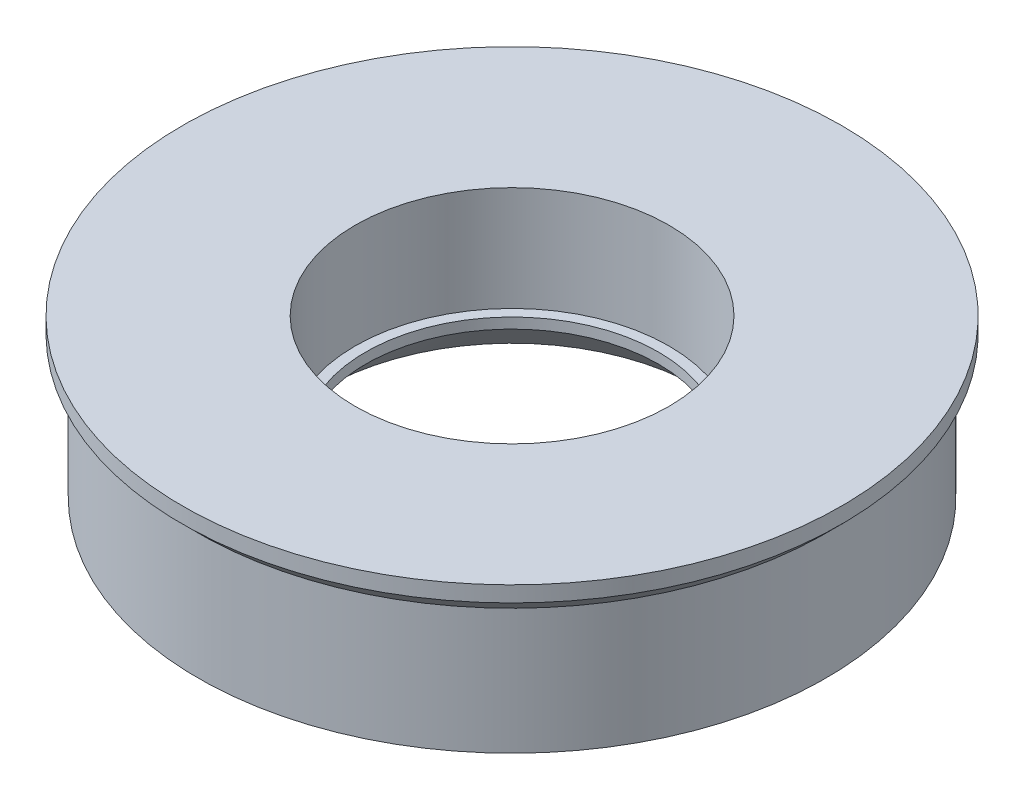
ISO-10303-21;
HEADER;
FILE_DESCRIPTION(('STEP AP214'),'2;1');
FILE_NAME('part.step','',(''),(''),'','','');
FILE_SCHEMA(('AUTOMOTIVE_DESIGN { 1 0 10303 214 1 1 1 1 }'));
ENDSEC;
DATA;
#1=APPLICATION_CONTEXT('core data for automotive mechanical design processes');
#2=APPLICATION_PROTOCOL_DEFINITION('international standard','automotive_design',2000,#1);
#3=PRODUCT_CONTEXT('',#1,'mechanical');
#4=PRODUCT('Part','Part','',(#3));
#5=PRODUCT_RELATED_PRODUCT_CATEGORY('part','',(#4));
#6=PRODUCT_DEFINITION_FORMATION('','',#4);
#7=PRODUCT_DEFINITION_CONTEXT('part definition',#1,'design');
#8=PRODUCT_DEFINITION('design','',#6,#7);
#9=PRODUCT_DEFINITION_SHAPE('','',#8);
#10=(LENGTH_UNIT() NAMED_UNIT(*) SI_UNIT(.MILLI.,.METRE.));
#11=(NAMED_UNIT(*) PLANE_ANGLE_UNIT() SI_UNIT($,.RADIAN.));
#12=(NAMED_UNIT(*) SI_UNIT($,.STERADIAN.) SOLID_ANGLE_UNIT());
#13=UNCERTAINTY_MEASURE_WITH_UNIT(LENGTH_MEASURE(1.E-05),#10,'distance_accuracy_value','');
#14=(GEOMETRIC_REPRESENTATION_CONTEXT(3) GLOBAL_UNCERTAINTY_ASSIGNED_CONTEXT((#13)) GLOBAL_UNIT_ASSIGNED_CONTEXT((#10,
#11,#12)) REPRESENTATION_CONTEXT('',''));
#15=CARTESIAN_POINT('',(0.,0.,0.));
#16=DIRECTION('',(0.,0.,1.));
#17=DIRECTION('',(1.,0.,0.));
#18=AXIS2_PLACEMENT_3D('',#15,#16,#17);
#19=CARTESIAN_POINT('',(15.,4.9999999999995,0.));
#20=DIRECTION('',(0.,1.,0.));
#21=DIRECTION('',(0.,0.,1.));
#22=AXIS2_PLACEMENT_3D('',#19,#20,#21);
#23=PLANE('',#22);
#24=CARTESIAN_POINT('',(0.,4.9999999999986,2.22044604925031E-13));
#25=DIRECTION('',(0.,-1.,0.));
#26=DIRECTION('',(0.,0.,-1.));
#27=AXIS2_PLACEMENT_3D('',#24,#25,#26);
#28=CIRCLE('',#27,14.);
#29=CARTESIAN_POINT('',(0.,4.9999999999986,-13.9999999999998));
#30=VERTEX_POINT('',#29);
#31=EDGE_CURVE('E54',#30,#30,#28,.T.);
#32=ORIENTED_EDGE('',*,*,#31,.T.);
#33=EDGE_LOOP('',(#32));
#34=FACE_BOUND('',#33,.T.);
#35=CARTESIAN_POINT('',(0.,4.9999999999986,2.22044604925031E-13));
#36=DIRECTION('',(0.,-1.,0.));
#37=DIRECTION('',(0.,0.,-1.));
#38=AXIS2_PLACEMENT_3D('',#35,#36,#37);
#39=CIRCLE('',#38,15.);
#40=CARTESIAN_POINT('',(0.,4.9999999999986,-14.9999999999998));
#41=VERTEX_POINT('',#40);
#42=EDGE_CURVE('E71',#41,#41,#39,.T.);
#43=ORIENTED_EDGE('',*,*,#42,.F.);
#44=EDGE_LOOP('',(#43));
#45=FACE_BOUND('',#44,.T.);
#46=ADVANCED_FACE('F40',(#34,#45),#23,.T.);
#47=CARTESIAN_POINT('',(-1.11022302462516E-13,-1.16573417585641E-12,1.66533453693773E-13));
#48=DIRECTION('',(0.,-1.,0.));
#49=DIRECTION('',(0.,0.,-1.));
#50=AXIS2_PLACEMENT_3D('',#47,#48,#49);
#51=CYLINDRICAL_SURFACE('',#50,14.);
#52=CARTESIAN_POINT('',(0.,3.99999999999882,2.22044604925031E-13));
#53=DIRECTION('',(0.,-1.,0.));
#54=DIRECTION('',(0.,0.,-1.));
#55=AXIS2_PLACEMENT_3D('',#52,#53,#54);
#56=CIRCLE('',#55,14.);
#57=CARTESIAN_POINT('',(0.,3.99999999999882,-13.9999999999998));
#58=VERTEX_POINT('',#57);
#59=EDGE_CURVE('E50',#58,#58,#56,.T.);
#60=ORIENTED_EDGE('',*,*,#59,.T.);
#61=EDGE_LOOP('',(#60));
#62=FACE_BOUND('',#61,.T.);
#63=ORIENTED_EDGE('',*,*,#31,.F.);
#64=EDGE_LOOP('',(#63));
#65=FACE_BOUND('',#64,.T.);
#66=ADVANCED_FACE('F79',(#62,#65),#51,.F.);
#67=CARTESIAN_POINT('',(14.,0.,0.));
#68=DIRECTION('',(0.,-1.,0.));
#69=DIRECTION('',(0.,0.,-1.));
#70=AXIS2_PLACEMENT_3D('',#67,#68,#69);
#71=PLANE('',#70);
#72=CARTESIAN_POINT('',(-1.11022302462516E-13,-1.16573417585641E-12,1.66533453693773E-13));
#73=DIRECTION('',(0.,-1.,0.));
#74=DIRECTION('',(0.,0.,-1.));
#75=AXIS2_PLACEMENT_3D('',#72,#73,#74);
#76=CIRCLE('',#75,18.);
#77=CARTESIAN_POINT('',(-1.0902390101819E-13,-1.1662337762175E-12,-17.9999999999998));
#78=VERTEX_POINT('',#77);
#79=EDGE_CURVE('E46',#78,#78,#76,.F.);
#80=ORIENTED_EDGE('',*,*,#79,.T.);
#81=EDGE_LOOP('',(#80));
#82=FACE_BOUND('',#81,.T.);
#83=CARTESIAN_POINT('',(-1.11022302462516E-13,-1.16573417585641E-12,1.66533453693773E-13));
#84=DIRECTION('',(0.,-1.,0.));
#85=DIRECTION('',(0.,0.,-1.));
#86=AXIS2_PLACEMENT_3D('',#83,#84,#85);
#87=CIRCLE('',#86,30.);
#88=CARTESIAN_POINT('',(-1.0769163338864E-13,-1.16656684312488E-12,-29.9999999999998));
#89=VERTEX_POINT('',#88);
#90=EDGE_CURVE('E59',#89,#89,#87,.T.);
#91=ORIENTED_EDGE('',*,*,#90,.T.);
#92=EDGE_LOOP('',(#91));
#93=FACE_BOUND('',#92,.T.);
#94=ADVANCED_FACE('F84',(#82,#93),#71,.T.);
#95=CARTESIAN_POINT('',(-1.11022302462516E-13,-1.16573417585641E-12,1.66533453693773E-13));
#96=DIRECTION('',(0.,-1.,0.));
#97=DIRECTION('',(0.,0.,-1.));
#98=AXIS2_PLACEMENT_3D('',#95,#96,#97);
#99=CYLINDRICAL_SURFACE('',#98,30.);
#100=CARTESIAN_POINT('',(-1.11022302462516E-13,11.9999999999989,3.05311331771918E-13));
#101=DIRECTION('',(0.,-1.,0.));
#102=DIRECTION('',(0.,0.,-1.));
#103=AXIS2_PLACEMENT_3D('',#100,#101,#102);
#104=CIRCLE('',#103,30.);
#105=CARTESIAN_POINT('',(-1.0769163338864E-13,11.9999999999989,-29.9999999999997));
#106=VERTEX_POINT('',#105);
#107=EDGE_CURVE('E62',#106,#106,#104,.T.);
#108=ORIENTED_EDGE('',*,*,#107,.T.);
#109=EDGE_LOOP('',(#108));
#110=FACE_BOUND('',#109,.T.);
#111=ORIENTED_EDGE('',*,*,#90,.F.);
#112=EDGE_LOOP('',(#111));
#113=FACE_BOUND('',#112,.T.);
#114=ADVANCED_FACE('F91',(#110,#113),#99,.T.);
#115=CARTESIAN_POINT('',(-1.11022302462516E-13,-1.16573417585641E-12,1.66533453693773E-13));
#116=DIRECTION('',(0.,-1.,0.));
#117=DIRECTION('',(0.,0.,-1.));
#118=AXIS2_PLACEMENT_3D('',#115,#116,#117);
#119=CYLINDRICAL_SURFACE('',#118,31.5);
#120=CARTESIAN_POINT('',(0.,13.4999999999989,2.4980018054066E-13));
#121=DIRECTION('',(0.,-1.,0.));
#122=DIRECTION('',(0.,0.,-1.));
#123=AXIS2_PLACEMENT_3D('',#120,#121,#122);
#124=CIRCLE('',#123,31.5);
#125=CARTESIAN_POINT('',(0.,13.4999999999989,-31.4999999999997));
#126=VERTEX_POINT('',#125);
#127=EDGE_CURVE('E10',#126,#126,#124,.F.);
#128=ORIENTED_EDGE('',*,*,#127,.T.);
#129=EDGE_LOOP('',(#128));
#130=FACE_BOUND('',#129,.T.);
#131=CARTESIAN_POINT('',(-1.11022302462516E-13,14.9999999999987,0.));
#132=DIRECTION('',(0.,-1.,0.));
#133=DIRECTION('',(0.,0.,-1.));
#134=AXIS2_PLACEMENT_3D('',#131,#132,#133);
#135=CIRCLE('',#134,31.5);
#136=CARTESIAN_POINT('',(-1.07525099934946E-13,14.9999999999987,-31.4999999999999));
#137=VERTEX_POINT('',#136);
#138=EDGE_CURVE('E65',#137,#137,#135,.T.);
#139=ORIENTED_EDGE('',*,*,#138,.T.);
#140=EDGE_LOOP('',(#139));
#141=FACE_BOUND('',#140,.T.);
#142=ADVANCED_FACE('F96',(#130,#141),#119,.T.);
#143=CARTESIAN_POINT('',(31.5,14.9999999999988,0.));
#144=DIRECTION('',(0.,1.,0.));
#145=DIRECTION('',(0.,0.,1.));
#146=AXIS2_PLACEMENT_3D('',#143,#144,#145);
#147=PLANE('',#146);
#148=CARTESIAN_POINT('',(-1.11022302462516E-13,14.9999999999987,0.));
#149=DIRECTION('',(0.,-1.,0.));
#150=DIRECTION('',(0.,0.,-1.));
#151=AXIS2_PLACEMENT_3D('',#148,#149,#150);
#152=CIRCLE('',#151,15.);
#153=CARTESIAN_POINT('',(-1.09356967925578E-13,14.9999999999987,-14.9999999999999));
#154=VERTEX_POINT('',#153);
#155=EDGE_CURVE('E68',#154,#154,#152,.T.);
#156=ORIENTED_EDGE('',*,*,#155,.T.);
#157=EDGE_LOOP('',(#156));
#158=FACE_BOUND('',#157,.T.);
#159=ORIENTED_EDGE('',*,*,#138,.F.);
#160=EDGE_LOOP('',(#159));
#161=FACE_BOUND('',#160,.T.);
#162=ADVANCED_FACE('F100',(#158,#161),#147,.T.);
#163=CARTESIAN_POINT('',(-1.11022302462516E-13,-1.16573417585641E-12,1.66533453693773E-13));
#164=DIRECTION('',(0.,-1.,0.));
#165=DIRECTION('',(0.,0.,-1.));
#166=AXIS2_PLACEMENT_3D('',#163,#164,#165);
#167=CYLINDRICAL_SURFACE('',#166,15.);
#168=ORIENTED_EDGE('',*,*,#42,.T.);
#169=EDGE_LOOP('',(#168));
#170=FACE_BOUND('',#169,.T.);
#171=ORIENTED_EDGE('',*,*,#155,.F.);
#172=EDGE_LOOP('',(#171));
#173=FACE_BOUND('',#172,.T.);
#174=ADVANCED_FACE('F75',(#170,#173),#167,.F.);
#175=CARTESIAN_POINT('',(0.,3.99999999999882,2.22044604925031E-13));
#176=DIRECTION('',(0.,-1.,0.));
#177=DIRECTION('',(0.,0.,-1.));
#178=AXIS2_PLACEMENT_3D('',#175,#176,#177);
#179=CONICAL_SURFACE('',#178,14.,0.78539816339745);
#180=ORIENTED_EDGE('',*,*,#79,.F.);
#181=EDGE_LOOP('',(#180));
#182=FACE_BOUND('',#181,.T.);
#183=ORIENTED_EDGE('',*,*,#59,.F.);
#184=EDGE_LOOP('',(#183));
#185=FACE_BOUND('',#184,.T.);
#186=ADVANCED_FACE('F106',(#182,#185),#179,.F.);
#187=CARTESIAN_POINT('',(-1.11022302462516E-13,11.9999999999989,3.05311331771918E-13));
#188=DIRECTION('',(0.,1.,0.));
#189=DIRECTION('',(0.,0.,1.));
#190=AXIS2_PLACEMENT_3D('',#187,#188,#189);
#191=CONICAL_SURFACE('',#190,30.,0.785398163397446);
#192=ORIENTED_EDGE('',*,*,#127,.F.);
#193=EDGE_LOOP('',(#192));
#194=FACE_BOUND('',#193,.T.);
#195=ORIENTED_EDGE('',*,*,#107,.F.);
#196=EDGE_LOOP('',(#195));
#197=FACE_BOUND('',#196,.T.);
#198=ADVANCED_FACE('F109',(#194,#197),#191,.T.);
#199=CLOSED_SHELL('',(#46,#66,#94,#114,#142,#162,#174,#186,#198));
#200=MANIFOLD_SOLID_BREP('B2',#199);
#201=ADVANCED_BREP_SHAPE_REPRESENTATION('',(#18,#200),#14);
#202=SHAPE_DEFINITION_REPRESENTATION(#9,#201);
ENDSEC;
END-ISO-10303-21;
